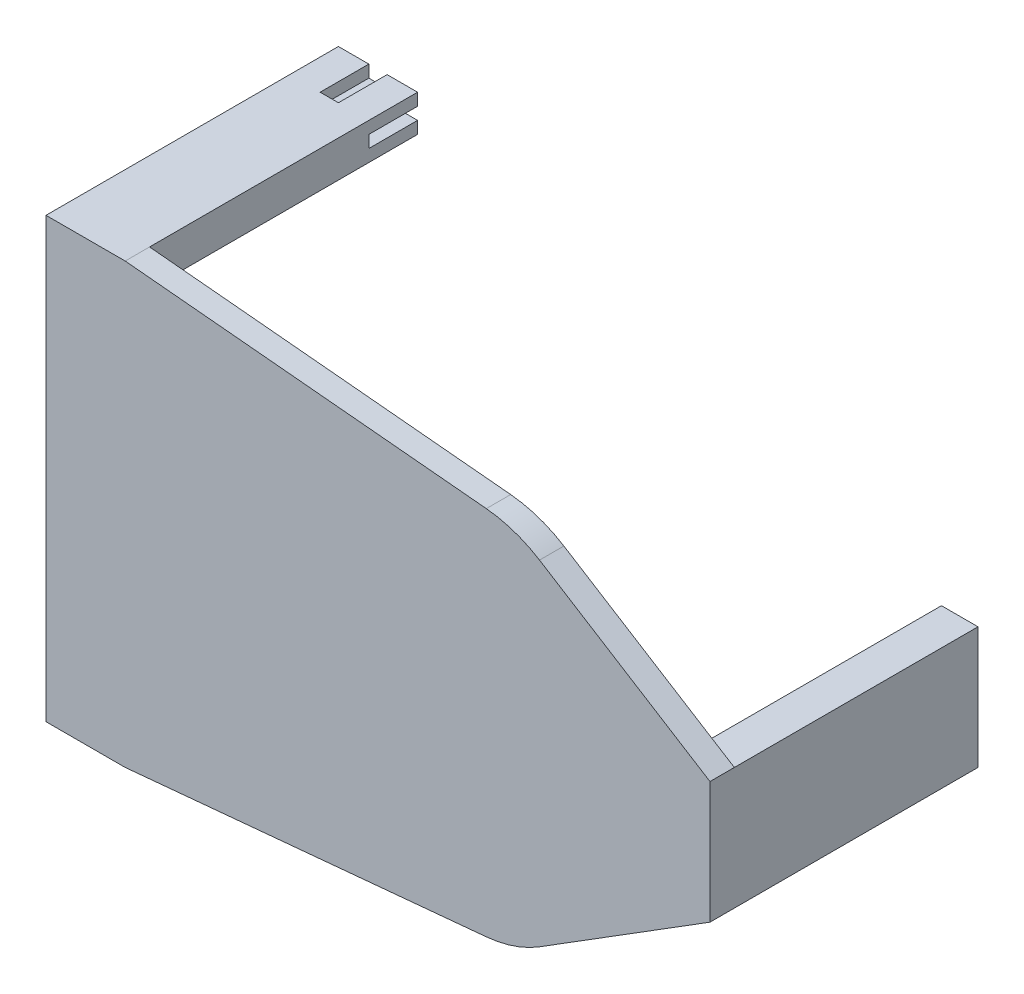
from build123d import *

# Parameters (mm, degrees)
SKETCH_1_W          = 38.5
SKETCH_1_H          = 30
EXTRUDE_1_DEPTH     = 2
SKETCH_3_W          = 6.5
SKETCH_3_H          = 3
EXTRUDE_2_DEPTH     = 20
SKETCH_6_W          = 2.5
SKETCH_6_H          = 1
EXTRUDE_6_DEPTH     = 4
SKETCH_7_W          = 3
SKETCH_7_H          = 10
EXTRUDE_7_DEPTH     = 20
SKETCH_8_R          = 1
CUT_EXTRUDE_1_DEPTH = 3
EXTRUDE_8_DEPTH     = 2
FILLET_1_R          = 10


with BuildPart() as part:
    # Sketch 1 → Extrude 1 (new body)
    with BuildSketch(Plane.XY):
        Polygon((35.25, -5), (19.25, -15), (19.25, 15), (35.25, 5), align=None)
        Rectangle(SKETCH_1_W, SKETCH_1_H)
    extrude(amount=EXTRUDE_1_DEPTH)

    # Sketch 3 → Extrude 2 (add)
    with BuildSketch(Plane.XY.offset(2)):
        with Locations((-16, 16.5)):
            Rectangle(SKETCH_3_W, SKETCH_3_H)
        with Locations((-16, -16.5)):
            Rectangle(SKETCH_3_W, SKETCH_3_H)
    extrude(amount=-EXTRUDE_2_DEPTH)

    # Sketch 6 → Extrude 6 (add)
    with BuildSketch(Plane(origin=(0, 0, -18), x_dir=(-1, 0, 0), z_dir=(0, 0, -1))):
        Polygon((15.25, 15), (15.25, 16), (14.75, 16), (12.75, 16), (12.75, 15), align=None)
        with Locations((16, 16.5)):
            Rectangle(SKETCH_6_W, SKETCH_6_H)
        Polygon((14.75, 17), (15.25, 17), (15.25, 18), (12.75, 18), (12.75, 17), align=None)
        Polygon((16.75, 17), (17.25, 17), (19.25, 17), (19.25, 18), (16.75, 18), align=None)
        Polygon((19.25, 16), (17.25, 16), (16.75, 16), (16.75, 15), (19.25, 15), align=None)
    extrude_6 = extrude(amount=EXTRUDE_6_DEPTH)

    # Mirror 3: Extrude 6 across plane
    add(extrude_6.mirror(Plane.ZX))

    # Sketch 7 → Extrude 7 (add)
    with BuildSketch(Plane(origin=(0, 0, 0), x_dir=(-1, 0, 0), z_dir=(0, 0, -1))):
        with Locations((-33.75, 0)):
            Rectangle(SKETCH_7_W, SKETCH_7_H)
    extrude(amount=EXTRUDE_7_DEPTH)

    # Sketch 8 → Cut-Extrude 1 (cut)
    with BuildSketch(Plane(origin=(0, 0, -20), x_dir=(-1, 0, 0), z_dir=(0, 0, -1))):
        with Locations((-33.75, 2)):
            Circle(SKETCH_8_R)
        with Locations((-33.75, -2)):
            Circle(SKETCH_8_R)
    extrude(amount=-CUT_EXTRUDE_1_DEPTH, mode=Mode.SUBTRACT)

    # Sketch 9 → Extrude 8 (add)
    with BuildSketch(Plane.XY.offset(2)):
        Polygon((-12.75, 18), (19.25, 15), (-12.75, 15), align=None)
        Polygon((-12.75, -15), (19.25, -15), (-12.75, -18), align=None)
    extrude(amount=-EXTRUDE_8_DEPTH)

    # Fillet 1
    fillet_1_edges = [part.edges().sort_by_distance(p)[0] for p in [
        (19.25, -15, 1),
        (19.25, 15, 1),
    ]]
    fillet(fillet_1_edges, radius=FILLET_1_R)


solid = part.part
